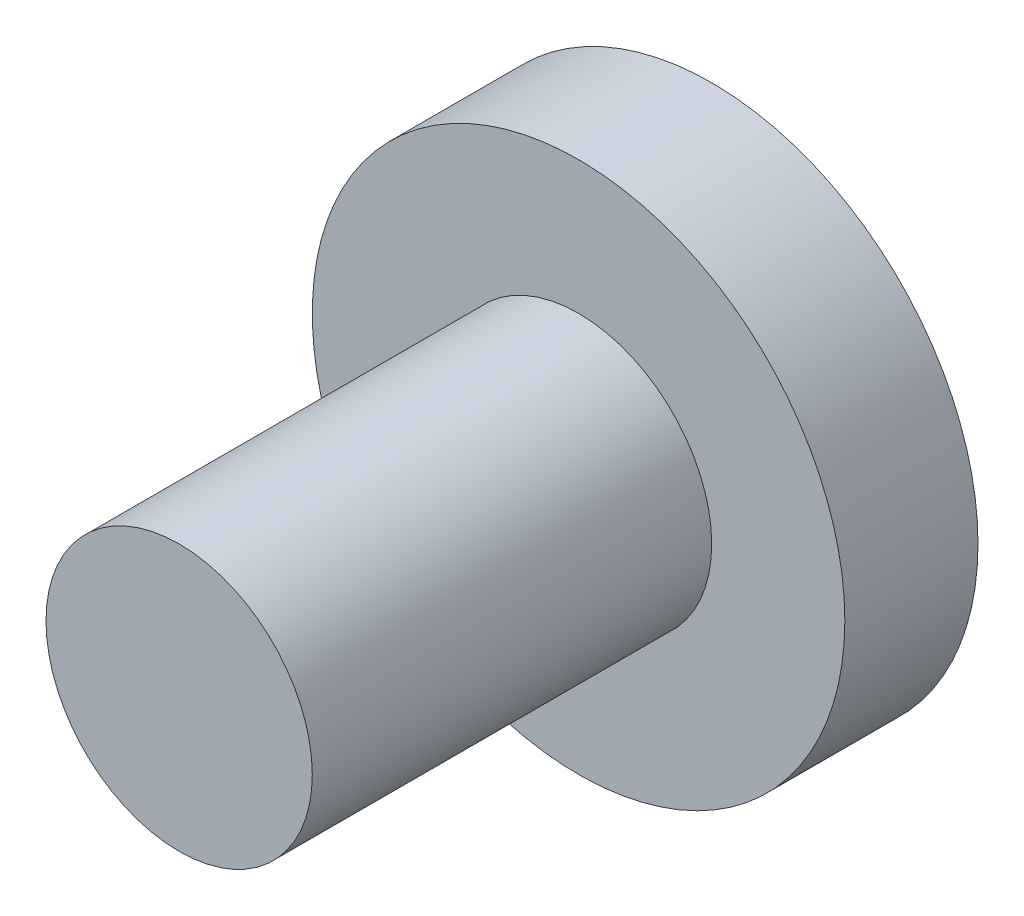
from build123d import *

# Parameters (mm, degrees)
ESQUISSE1_R             = 10
BASE_EXTRUSION_DEPTH    = 20
ESQUISSE2_OUTSIDE_W     = 28.928
ESQUISSE2_OUTSIDE_H     = 28.928
ESQUISSE2_OUTSIDE_R     = 5
ENL_V_MAT_EXTRU_1_DEPTH = 15


with BuildPart() as part:
    # Esquisse1 → Base-Extrusion (new body)
    with BuildSketch(Plane.XY):
        Circle(ESQUISSE1_R)
    extrude(amount=BASE_EXTRUSION_DEPTH)

    # Esquisse2 outside → Enl_v. mat.-Extru.1 (cut)
    with BuildSketch(Plane.XY.offset(20)):
        Rectangle(ESQUISSE2_OUTSIDE_W, ESQUISSE2_OUTSIDE_H)
        Circle(ESQUISSE2_OUTSIDE_R, mode=Mode.SUBTRACT)
    extrude(amount=-ENL_V_MAT_EXTRU_1_DEPTH, mode=Mode.SUBTRACT)


solid = part.part
